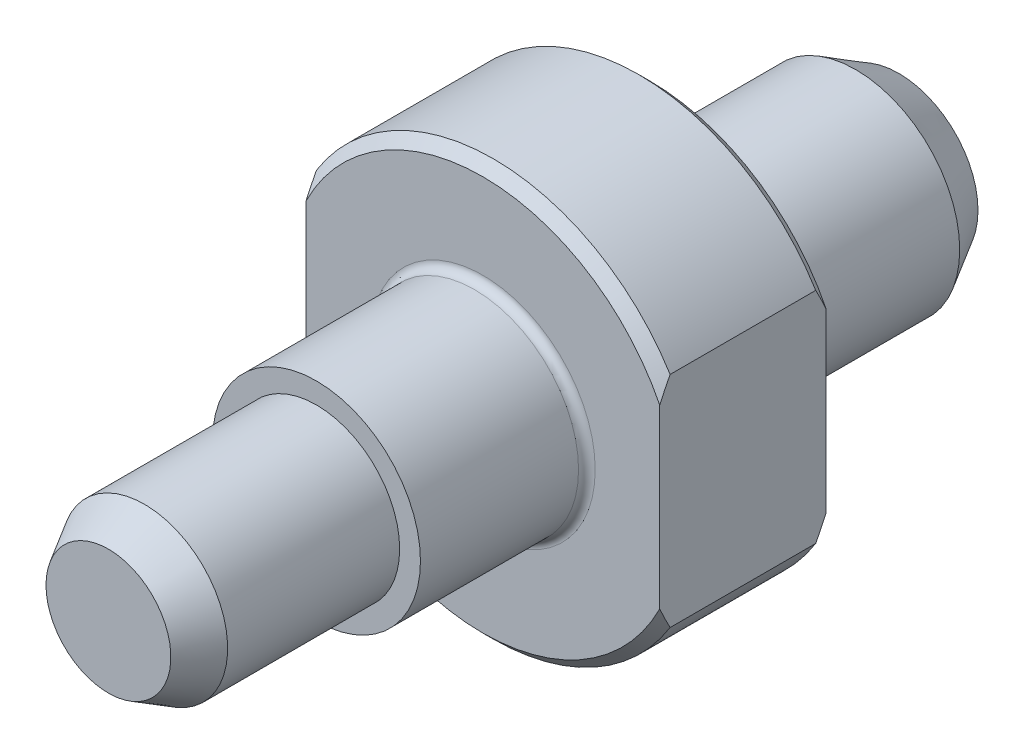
ISO-10303-21;
HEADER;
FILE_DESCRIPTION(('STEP AP214'),'2;1');
FILE_NAME('part.step','',(''),(''),'','','');
FILE_SCHEMA(('AUTOMOTIVE_DESIGN { 1 0 10303 214 1 1 1 1 }'));
ENDSEC;
DATA;
#1=APPLICATION_CONTEXT('core data for automotive mechanical design processes');
#2=APPLICATION_PROTOCOL_DEFINITION('international standard','automotive_design',2000,#1);
#3=PRODUCT_CONTEXT('',#1,'mechanical');
#4=PRODUCT('Part','Part','',(#3));
#5=PRODUCT_RELATED_PRODUCT_CATEGORY('part','',(#4));
#6=PRODUCT_DEFINITION_FORMATION('','',#4);
#7=PRODUCT_DEFINITION_CONTEXT('part definition',#1,'design');
#8=PRODUCT_DEFINITION('design','',#6,#7);
#9=PRODUCT_DEFINITION_SHAPE('','',#8);
#10=(LENGTH_UNIT() NAMED_UNIT(*) SI_UNIT(.MILLI.,.METRE.));
#11=(NAMED_UNIT(*) PLANE_ANGLE_UNIT() SI_UNIT($,.RADIAN.));
#12=(NAMED_UNIT(*) SI_UNIT($,.STERADIAN.) SOLID_ANGLE_UNIT());
#13=UNCERTAINTY_MEASURE_WITH_UNIT(LENGTH_MEASURE(1.E-05),#10,'distance_accuracy_value','');
#14=(GEOMETRIC_REPRESENTATION_CONTEXT(3) GLOBAL_UNCERTAINTY_ASSIGNED_CONTEXT((#13)) GLOBAL_UNIT_ASSIGNED_CONTEXT((#10,
#11,#12)) REPRESENTATION_CONTEXT('',''));
#15=CARTESIAN_POINT('',(0.,0.,0.));
#16=DIRECTION('',(0.,0.,1.));
#17=DIRECTION('',(1.,0.,0.));
#18=AXIS2_PLACEMENT_3D('',#15,#16,#17);
#19=CARTESIAN_POINT('',(0.,0.,0.));
#20=DIRECTION('',(0.,0.,1.));
#21=DIRECTION('',(1.,0.,0.));
#22=AXIS2_PLACEMENT_3D('',#19,#20,#21);
#23=PLANE('',#22);
#24=CARTESIAN_POINT('',(0.,0.,0.));
#25=DIRECTION('',(0.,0.,1.));
#26=DIRECTION('',(1.,0.,0.));
#27=AXIS2_PLACEMENT_3D('',#24,#25,#26);
#28=CIRCLE('',#27,5.4);
#29=CARTESIAN_POINT('',(5.4,0.,0.));
#30=VERTEX_POINT('',#29);
#31=EDGE_CURVE('E190',#30,#30,#28,.T.);
#32=ORIENTED_EDGE('',*,*,#31,.T.);
#33=EDGE_LOOP('',(#32));
#34=FACE_BOUND('',#33,.T.);
#35=DIRECTION('',(0.,-1.,0.));
#36=VECTOR('',#35,1.);
#37=CARTESIAN_POINT('',(8.5,0.,0.));
#38=LINE('',#37,#36);
#39=CARTESIAN_POINT('',(8.5,4.24264068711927,0.));
#40=VERTEX_POINT('',#39);
#41=CARTESIAN_POINT('',(8.5,-4.24264068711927,0.));
#42=VERTEX_POINT('',#41);
#43=EDGE_CURVE('E259',#40,#42,#38,.T.);
#44=ORIENTED_EDGE('',*,*,#43,.T.);
#45=CARTESIAN_POINT('',(0.,0.,0.));
#46=DIRECTION('',(0.,0.,1.));
#47=DIRECTION('',(1.,0.,0.));
#48=AXIS2_PLACEMENT_3D('',#45,#46,#47);
#49=CIRCLE('',#48,9.5);
#50=CARTESIAN_POINT('',(-8.5,-4.24264068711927,0.));
#51=VERTEX_POINT('',#50);
#52=EDGE_CURVE('E392',#42,#51,#49,.F.);
#53=ORIENTED_EDGE('',*,*,#52,.T.);
#54=DIRECTION('',(0.,-1.,0.));
#55=VECTOR('',#54,1.);
#56=CARTESIAN_POINT('',(-8.5,0.,0.));
#57=LINE('',#56,#55);
#58=CARTESIAN_POINT('',(-8.5,4.24264068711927,0.));
#59=VERTEX_POINT('',#58);
#60=EDGE_CURVE('E87',#59,#51,#57,.T.);
#61=ORIENTED_EDGE('',*,*,#60,.F.);
#62=CARTESIAN_POINT('',(0.,0.,0.));
#63=DIRECTION('',(0.,0.,1.));
#64=DIRECTION('',(1.,0.,0.));
#65=AXIS2_PLACEMENT_3D('',#62,#63,#64);
#66=CIRCLE('',#65,9.5);
#67=EDGE_CURVE('E391',#59,#40,#66,.F.);
#68=ORIENTED_EDGE('',*,*,#67,.T.);
#69=EDGE_LOOP('',(#44,#53,#61,#68));
#70=FACE_BOUND('',#69,.T.);
#71=ADVANCED_FACE('F14',(#34,#70),#23,.F.);
#72=CARTESIAN_POINT('',(0.,0.,8.));
#73=DIRECTION('',(0.,0.,-1.));
#74=DIRECTION('',(-1.,0.,0.));
#75=AXIS2_PLACEMENT_3D('',#72,#73,#74);
#76=CYLINDRICAL_SURFACE('',#75,10.);
#77=DIRECTION('',(0.,0.,1.));
#78=VECTOR('',#77,1.);
#79=CARTESIAN_POINT('',(8.5,5.26782687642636,-12.));
#80=LINE('',#79,#78);
#81=CARTESIAN_POINT('',(8.5,5.26782687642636,0.5));
#82=VERTEX_POINT('',#81);
#83=CARTESIAN_POINT('',(8.5,5.26782687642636,7.5));
#84=VERTEX_POINT('',#83);
#85=EDGE_CURVE('E266',#82,#84,#80,.T.);
#86=ORIENTED_EDGE('',*,*,#85,.F.);
#87=CARTESIAN_POINT('',(0.,0.,0.5));
#88=DIRECTION('',(0.,0.,1.));
#89=DIRECTION('',(1.,0.,0.));
#90=AXIS2_PLACEMENT_3D('',#87,#88,#89);
#91=CIRCLE('',#90,10.);
#92=CARTESIAN_POINT('',(-8.5,5.26782687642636,0.5));
#93=VERTEX_POINT('',#92);
#94=EDGE_CURVE('E188',#82,#93,#91,.T.);
#95=ORIENTED_EDGE('',*,*,#94,.T.);
#96=DIRECTION('',(0.,0.,1.));
#97=VECTOR('',#96,1.);
#98=CARTESIAN_POINT('',(-8.5,5.26782687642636,-12.));
#99=LINE('',#98,#97);
#100=CARTESIAN_POINT('',(-8.5,5.26782687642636,7.5));
#101=VERTEX_POINT('',#100);
#102=EDGE_CURVE('E102',#93,#101,#99,.T.);
#103=ORIENTED_EDGE('',*,*,#102,.T.);
#104=CARTESIAN_POINT('',(0.,0.,7.5));
#105=DIRECTION('',(0.,0.,1.));
#106=DIRECTION('',(1.,0.,0.));
#107=AXIS2_PLACEMENT_3D('',#104,#105,#106);
#108=CIRCLE('',#107,10.);
#109=EDGE_CURVE('E186',#101,#84,#108,.F.);
#110=ORIENTED_EDGE('',*,*,#109,.T.);
#111=EDGE_LOOP('',(#86,#95,#103,#110));
#112=FACE_BOUND('',#111,.T.);
#113=ADVANCED_FACE('F216',(#112),#76,.T.);
#114=DIRECTION('',(0.,0.,1.));
#115=VECTOR('',#114,1.);
#116=CARTESIAN_POINT('',(-8.5,-5.26782687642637,-12.));
#117=LINE('',#116,#115);
#118=CARTESIAN_POINT('',(-8.5,-5.26782687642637,0.5));
#119=VERTEX_POINT('',#118);
#120=CARTESIAN_POINT('',(-8.5,-5.26782687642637,7.5));
#121=VERTEX_POINT('',#120);
#122=EDGE_CURVE('E84',#119,#121,#117,.T.);
#123=ORIENTED_EDGE('',*,*,#122,.F.);
#124=CARTESIAN_POINT('',(0.,0.,0.5));
#125=DIRECTION('',(0.,0.,1.));
#126=DIRECTION('',(1.,0.,0.));
#127=AXIS2_PLACEMENT_3D('',#124,#125,#126);
#128=CIRCLE('',#127,10.);
#129=CARTESIAN_POINT('',(8.5,-5.26782687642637,0.5));
#130=VERTEX_POINT('',#129);
#131=EDGE_CURVE('E98',#119,#130,#128,.T.);
#132=ORIENTED_EDGE('',*,*,#131,.T.);
#133=DIRECTION('',(0.,0.,1.));
#134=VECTOR('',#133,1.);
#135=CARTESIAN_POINT('',(8.5,-5.26782687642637,-12.));
#136=LINE('',#135,#134);
#137=CARTESIAN_POINT('',(8.5,-5.26782687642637,7.5));
#138=VERTEX_POINT('',#137);
#139=EDGE_CURVE('E262',#130,#138,#136,.T.);
#140=ORIENTED_EDGE('',*,*,#139,.T.);
#141=CARTESIAN_POINT('',(0.,0.,7.5));
#142=DIRECTION('',(0.,0.,1.));
#143=DIRECTION('',(1.,0.,0.));
#144=AXIS2_PLACEMENT_3D('',#141,#142,#143);
#145=CIRCLE('',#144,10.);
#146=EDGE_CURVE('E101',#138,#121,#145,.F.);
#147=ORIENTED_EDGE('',*,*,#146,.T.);
#148=EDGE_LOOP('',(#123,#132,#140,#147));
#149=FACE_BOUND('',#148,.T.);
#150=ADVANCED_FACE('F96',(#149),#76,.T.);
#151=CARTESIAN_POINT('',(0.,0.,8.));
#152=DIRECTION('',(0.,0.,1.));
#153=DIRECTION('',(1.,0.,0.));
#154=AXIS2_PLACEMENT_3D('',#151,#152,#153);
#155=PLANE('',#154);
#156=CARTESIAN_POINT('',(0.,0.,8.));
#157=DIRECTION('',(0.,0.,1.));
#158=DIRECTION('',(1.,0.,0.));
#159=AXIS2_PLACEMENT_3D('',#156,#157,#158);
#160=CIRCLE('',#159,5.4);
#161=CARTESIAN_POINT('',(5.4,0.,8.));
#162=VERTEX_POINT('',#161);
#163=EDGE_CURVE('E9',#162,#162,#160,.F.);
#164=ORIENTED_EDGE('',*,*,#163,.T.);
#165=EDGE_LOOP('',(#164));
#166=FACE_BOUND('',#165,.T.);
#167=DIRECTION('',(0.,-1.,0.));
#168=VECTOR('',#167,1.);
#169=CARTESIAN_POINT('',(-8.5,5.26782687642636,8.));
#170=LINE('',#169,#168);
#171=CARTESIAN_POINT('',(-8.5,4.24264068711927,8.));
#172=VERTEX_POINT('',#171);
#173=CARTESIAN_POINT('',(-8.5,-4.24264068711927,8.));
#174=VERTEX_POINT('',#173);
#175=EDGE_CURVE('E103',#172,#174,#170,.T.);
#176=ORIENTED_EDGE('',*,*,#175,.T.);
#177=CARTESIAN_POINT('',(0.,0.,8.));
#178=DIRECTION('',(0.,0.,1.));
#179=DIRECTION('',(1.,0.,0.));
#180=AXIS2_PLACEMENT_3D('',#177,#178,#179);
#181=CIRCLE('',#180,9.5);
#182=CARTESIAN_POINT('',(8.5,-4.24264068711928,8.));
#183=VERTEX_POINT('',#182);
#184=EDGE_CURVE('E183',#174,#183,#181,.T.);
#185=ORIENTED_EDGE('',*,*,#184,.T.);
#186=DIRECTION('',(0.,-1.,0.));
#187=VECTOR('',#186,1.);
#188=CARTESIAN_POINT('',(8.5,5.26782687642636,8.));
#189=LINE('',#188,#187);
#190=CARTESIAN_POINT('',(8.5,4.24264068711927,8.));
#191=VERTEX_POINT('',#190);
#192=EDGE_CURVE('E269',#191,#183,#189,.T.);
#193=ORIENTED_EDGE('',*,*,#192,.F.);
#194=CARTESIAN_POINT('',(0.,0.,8.));
#195=DIRECTION('',(0.,0.,1.));
#196=DIRECTION('',(1.,0.,0.));
#197=AXIS2_PLACEMENT_3D('',#194,#195,#196);
#198=CIRCLE('',#197,9.5);
#199=EDGE_CURVE('E91',#191,#172,#198,.T.);
#200=ORIENTED_EDGE('',*,*,#199,.T.);
#201=EDGE_LOOP('',(#176,#185,#193,#200));
#202=FACE_BOUND('',#201,.T.);
#203=ADVANCED_FACE('F229',(#166,#202),#155,.T.);
#204=CARTESIAN_POINT('',(0.,0.,0.));
#205=DIRECTION('',(0.,0.,-1.));
#206=DIRECTION('',(-1.,0.,0.));
#207=AXIS2_PLACEMENT_3D('',#204,#205,#206);
#208=CYLINDRICAL_SURFACE('',#207,5.);
#209=CARTESIAN_POINT('',(0.,0.,-9.92153903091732));
#210=DIRECTION('',(0.,0.,1.));
#211=DIRECTION('',(1.,0.,0.));
#212=AXIS2_PLACEMENT_3D('',#209,#210,#211);
#213=CIRCLE('',#212,5.);
#214=CARTESIAN_POINT('',(5.,0.,-9.92153903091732));
#215=VERTEX_POINT('',#214);
#216=EDGE_CURVE('E276',#215,#215,#213,.T.);
#217=ORIENTED_EDGE('',*,*,#216,.T.);
#218=EDGE_LOOP('',(#217));
#219=FACE_BOUND('',#218,.T.);
#220=CARTESIAN_POINT('',(0.,0.,-0.4));
#221=DIRECTION('',(0.,0.,1.));
#222=DIRECTION('',(1.,0.,0.));
#223=AXIS2_PLACEMENT_3D('',#220,#221,#222);
#224=CIRCLE('',#223,5.);
#225=CARTESIAN_POINT('',(5.,0.,-0.4));
#226=VERTEX_POINT('',#225);
#227=EDGE_CURVE('E193',#226,#226,#224,.F.);
#228=ORIENTED_EDGE('',*,*,#227,.T.);
#229=EDGE_LOOP('',(#228));
#230=FACE_BOUND('',#229,.T.);
#231=ADVANCED_FACE('F231',(#219,#230),#208,.T.);
#232=CARTESIAN_POINT('',(0.,0.,16.));
#233=DIRECTION('',(0.,0.,-1.));
#234=DIRECTION('',(-1.,0.,0.));
#235=AXIS2_PLACEMENT_3D('',#232,#233,#234);
#236=CYLINDRICAL_SURFACE('',#235,5.);
#237=CARTESIAN_POINT('',(0.,0.,8.4));
#238=DIRECTION('',(0.,0.,1.));
#239=DIRECTION('',(1.,0.,0.));
#240=AXIS2_PLACEMENT_3D('',#237,#238,#239);
#241=CIRCLE('',#240,5.);
#242=CARTESIAN_POINT('',(5.,0.,8.4));
#243=VERTEX_POINT('',#242);
#244=EDGE_CURVE('E22',#243,#243,#241,.T.);
#245=ORIENTED_EDGE('',*,*,#244,.T.);
#246=EDGE_LOOP('',(#245));
#247=FACE_BOUND('',#246,.T.);
#248=CARTESIAN_POINT('',(0.,0.,16.));
#249=DIRECTION('',(0.,0.,1.));
#250=DIRECTION('',(1.,0.,0.));
#251=AXIS2_PLACEMENT_3D('',#248,#249,#250);
#252=CIRCLE('',#251,5.);
#253=CARTESIAN_POINT('',(5.,0.,16.));
#254=VERTEX_POINT('',#253);
#255=EDGE_CURVE('E258',#254,#254,#252,.T.);
#256=ORIENTED_EDGE('',*,*,#255,.F.);
#257=EDGE_LOOP('',(#256));
#258=FACE_BOUND('',#257,.T.);
#259=ADVANCED_FACE('F198',(#247,#258),#236,.T.);
#260=CARTESIAN_POINT('',(0.,0.,16.));
#261=DIRECTION('',(0.,0.,1.));
#262=DIRECTION('',(1.,0.,0.));
#263=AXIS2_PLACEMENT_3D('',#260,#261,#262);
#264=PLANE('',#263);
#265=CARTESIAN_POINT('',(0.,0.,16.));
#266=DIRECTION('',(0.,0.,1.));
#267=DIRECTION('',(1.,0.,0.));
#268=AXIS2_PLACEMENT_3D('',#265,#266,#267);
#269=CIRCLE('',#268,4.);
#270=CARTESIAN_POINT('',(4.,0.,16.));
#271=VERTEX_POINT('',#270);
#272=EDGE_CURVE('E111',#271,#271,#269,.T.);
#273=ORIENTED_EDGE('',*,*,#272,.F.);
#274=EDGE_LOOP('',(#273));
#275=FACE_BOUND('',#274,.T.);
#276=ORIENTED_EDGE('',*,*,#255,.T.);
#277=EDGE_LOOP('',(#276));
#278=FACE_BOUND('',#277,.T.);
#279=ADVANCED_FACE('F239',(#275,#278),#264,.T.);
#280=CARTESIAN_POINT('',(0.,0.,26.));
#281=DIRECTION('',(0.,0.,-1.));
#282=DIRECTION('',(-1.,0.,0.));
#283=AXIS2_PLACEMENT_3D('',#280,#281,#282);
#284=CYLINDRICAL_SURFACE('',#283,4.);
#285=CARTESIAN_POINT('',(0.,0.,24.2679491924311));
#286=DIRECTION('',(0.,0.,-1.));
#287=DIRECTION('',(-1.,0.,0.));
#288=AXIS2_PLACEMENT_3D('',#285,#286,#287);
#289=CIRCLE('',#288,4.);
#290=CARTESIAN_POINT('',(-4.,0.,24.2679491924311));
#291=VERTEX_POINT('',#290);
#292=EDGE_CURVE('E281',#291,#291,#289,.T.);
#293=ORIENTED_EDGE('',*,*,#292,.T.);
#294=EDGE_LOOP('',(#293));
#295=FACE_BOUND('',#294,.T.);
#296=ORIENTED_EDGE('',*,*,#272,.T.);
#297=EDGE_LOOP('',(#296));
#298=FACE_BOUND('',#297,.T.);
#299=ADVANCED_FACE('F134',(#295,#298),#284,.T.);
#300=CARTESIAN_POINT('',(8.5,5.26782687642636,-12.));
#301=DIRECTION('',(-1.,0.,0.));
#302=DIRECTION('',(0.,-1.,0.));
#303=AXIS2_PLACEMENT_3D('',#300,#301,#302);
#304=PLANE('',#303);
#305=ORIENTED_EDGE('',*,*,#139,.F.);
#306=CARTESIAN_POINT('',(8.5,-5.26782687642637,0.5));
#307=CARTESIAN_POINT('',(8.5,-5.18370592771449,0.455687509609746));
#308=CARTESIAN_POINT('',(8.5,-5.09926830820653,0.411973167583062));
#309=CARTESIAN_POINT('',(8.5,-4.92976096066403,0.325844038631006));
#310=CARTESIAN_POINT('',(8.5,-4.84469140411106,0.283428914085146));
#311=CARTESIAN_POINT('',(8.5,-4.67387549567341,0.199977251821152));
#312=CARTESIAN_POINT('',(8.5,-4.58812912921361,0.158940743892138));
#313=CARTESIAN_POINT('',(8.5,-4.41592077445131,0.078338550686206));
#314=CARTESIAN_POINT('',(8.5,-4.32945860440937,0.0387732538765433));
#315=CARTESIAN_POINT('',(8.5,-4.24264068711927,0.));
#316=B_SPLINE_CURVE_WITH_KNOTS('',3,(#306,#307,#308,#309,#310,#311,#312,#313,#314,#315),
.UNSPECIFIED.,.F.,.F.,(4,2,2,2,4),(0.,0.285235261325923,0.570395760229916,0.855562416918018,
1.14080384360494),.UNSPECIFIED.);
#317=EDGE_CURVE('E106',#130,#42,#316,.T.);
#318=ORIENTED_EDGE('',*,*,#317,.T.);
#319=ORIENTED_EDGE('',*,*,#43,.F.);
#320=CARTESIAN_POINT('',(8.5,4.24264068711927,0.));
#321=CARTESIAN_POINT('',(8.5,4.32945860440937,0.038773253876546));
#322=CARTESIAN_POINT('',(8.5,4.41592077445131,0.0783385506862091));
#323=CARTESIAN_POINT('',(8.5,4.58812912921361,0.158940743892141));
#324=CARTESIAN_POINT('',(8.5,4.67387549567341,0.199977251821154));
#325=CARTESIAN_POINT('',(8.5,4.84469140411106,0.283428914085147));
#326=CARTESIAN_POINT('',(8.5,4.92976096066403,0.325844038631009));
#327=CARTESIAN_POINT('',(8.5,5.09926830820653,0.411973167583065));
#328=CARTESIAN_POINT('',(8.5,5.18370592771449,0.455687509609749));
#329=CARTESIAN_POINT('',(8.5,5.26782687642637,0.5));
#330=B_SPLINE_CURVE_WITH_KNOTS('',3,(#320,#321,#322,#323,#324,#325,#326,#327,#328,#329),
.UNSPECIFIED.,.F.,.F.,(4,2,2,2,4),(0.,0.285241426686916,0.570408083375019,0.855568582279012,
1.14080384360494),.UNSPECIFIED.);
#331=EDGE_CURVE('E109',#40,#82,#330,.T.);
#332=ORIENTED_EDGE('',*,*,#331,.T.);
#333=ORIENTED_EDGE('',*,*,#85,.T.);
#334=CARTESIAN_POINT('',(8.5,5.26782687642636,7.5));
#335=CARTESIAN_POINT('',(8.5,5.18370592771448,7.54431249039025));
#336=CARTESIAN_POINT('',(8.5,5.09926830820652,7.58802683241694));
#337=CARTESIAN_POINT('',(8.5,4.92976096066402,7.674155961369));
#338=CARTESIAN_POINT('',(8.5,4.84469140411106,7.71657108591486));
#339=CARTESIAN_POINT('',(8.5,4.67387549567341,7.80002274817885));
#340=CARTESIAN_POINT('',(8.5,4.58812912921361,7.84105925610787));
#341=CARTESIAN_POINT('',(8.5,4.41592077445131,7.92166144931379));
#342=CARTESIAN_POINT('',(8.5,4.32945860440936,7.96122674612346));
#343=CARTESIAN_POINT('',(8.5,4.24264068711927,8.));
#344=B_SPLINE_CURVE_WITH_KNOTS('',3,(#334,#335,#336,#337,#338,#339,#340,#341,#342,#343),
.UNSPECIFIED.,.F.,.F.,(4,2,2,2,4),(0.,0.285235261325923,0.570395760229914,0.855562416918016,
1.14080384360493),.UNSPECIFIED.);
#345=EDGE_CURVE('E107',#84,#191,#344,.T.);
#346=ORIENTED_EDGE('',*,*,#345,.T.);
#347=ORIENTED_EDGE('',*,*,#192,.T.);
#348=CARTESIAN_POINT('',(8.5,-4.24264068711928,8.));
#349=CARTESIAN_POINT('',(8.5,-4.32945860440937,7.96122674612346));
#350=CARTESIAN_POINT('',(8.5,-4.41592077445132,7.92166144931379));
#351=CARTESIAN_POINT('',(8.5,-4.58812912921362,7.84105925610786));
#352=CARTESIAN_POINT('',(8.5,-4.67387549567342,7.80002274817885));
#353=CARTESIAN_POINT('',(8.5,-4.84469140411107,7.71657108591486));
#354=CARTESIAN_POINT('',(8.5,-4.92976096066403,7.67415596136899));
#355=CARTESIAN_POINT('',(8.5,-5.09926830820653,7.58802683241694));
#356=CARTESIAN_POINT('',(8.5,-5.18370592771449,7.54431249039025));
#357=CARTESIAN_POINT('',(8.5,-5.26782687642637,7.5));
#358=B_SPLINE_CURVE_WITH_KNOTS('',3,(#348,#349,#350,#351,#352,#353,#354,#355,#356,#357),
.UNSPECIFIED.,.F.,.F.,(4,2,2,2,4),(0.,0.285241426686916,0.570408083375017,0.855568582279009,
1.14080384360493),.UNSPECIFIED.);
#359=EDGE_CURVE('E144',#183,#138,#358,.T.);
#360=ORIENTED_EDGE('',*,*,#359,.T.);
#361=EDGE_LOOP('',(#305,#318,#319,#332,#333,#346,#347,#360));
#362=FACE_BOUND('',#361,.T.);
#363=ADVANCED_FACE('F129',(#362),#304,.F.);
#364=CARTESIAN_POINT('',(-8.5,5.26782687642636,-12.));
#365=DIRECTION('',(-1.,0.,0.));
#366=DIRECTION('',(0.,0.,1.));
#367=AXIS2_PLACEMENT_3D('',#364,#365,#366);
#368=PLANE('',#367);
#369=ORIENTED_EDGE('',*,*,#60,.T.);
#370=CARTESIAN_POINT('',(-8.5,-4.24264068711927,0.));
#371=CARTESIAN_POINT('',(-8.5,-4.32945860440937,0.0387732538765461));
#372=CARTESIAN_POINT('',(-8.5,-4.41592077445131,0.0783385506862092));
#373=CARTESIAN_POINT('',(-8.5,-4.58812912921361,0.158940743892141));
#374=CARTESIAN_POINT('',(-8.5,-4.67387549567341,0.199977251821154));
#375=CARTESIAN_POINT('',(-8.5,-4.84469140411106,0.283428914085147));
#376=CARTESIAN_POINT('',(-8.5,-4.92976096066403,0.325844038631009));
#377=CARTESIAN_POINT('',(-8.5,-5.09926830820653,0.411973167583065));
#378=CARTESIAN_POINT('',(-8.5,-5.18370592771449,0.455687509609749));
#379=CARTESIAN_POINT('',(-8.5,-5.26782687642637,0.5));
#380=B_SPLINE_CURVE_WITH_KNOTS('',3,(#370,#371,#372,#373,#374,#375,#376,#377,#378,#379),
.UNSPECIFIED.,.F.,.F.,(4,2,2,2,4),(0.,0.285241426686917,0.57040808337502,0.855568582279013,
1.14080384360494),.UNSPECIFIED.);
#381=EDGE_CURVE('E81',#51,#119,#380,.T.);
#382=ORIENTED_EDGE('',*,*,#381,.T.);
#383=ORIENTED_EDGE('',*,*,#122,.T.);
#384=CARTESIAN_POINT('',(-8.5,-5.26782687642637,7.5));
#385=CARTESIAN_POINT('',(-8.5,-5.18370592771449,7.54431249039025));
#386=CARTESIAN_POINT('',(-8.5,-5.09926830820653,7.58802683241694));
#387=CARTESIAN_POINT('',(-8.5,-4.92976096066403,7.67415596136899));
#388=CARTESIAN_POINT('',(-8.5,-4.84469140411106,7.71657108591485));
#389=CARTESIAN_POINT('',(-8.5,-4.67387549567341,7.80002274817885));
#390=CARTESIAN_POINT('',(-8.5,-4.58812912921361,7.84105925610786));
#391=CARTESIAN_POINT('',(-8.5,-4.41592077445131,7.92166144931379));
#392=CARTESIAN_POINT('',(-8.5,-4.32945860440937,7.96122674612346));
#393=CARTESIAN_POINT('',(-8.5,-4.24264068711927,8.));
#394=B_SPLINE_CURVE_WITH_KNOTS('',3,(#384,#385,#386,#387,#388,#389,#390,#391,#392,#393),
.UNSPECIFIED.,.F.,.F.,(4,2,2,2,4),(0.,0.285235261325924,0.570395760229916,0.855562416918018,
1.14080384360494),.UNSPECIFIED.);
#395=EDGE_CURVE('E92',#121,#174,#394,.T.);
#396=ORIENTED_EDGE('',*,*,#395,.T.);
#397=ORIENTED_EDGE('',*,*,#175,.F.);
#398=CARTESIAN_POINT('',(-8.5,4.24264068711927,8.));
#399=CARTESIAN_POINT('',(-8.5,4.32945860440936,7.96122674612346));
#400=CARTESIAN_POINT('',(-8.5,4.41592077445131,7.92166144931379));
#401=CARTESIAN_POINT('',(-8.5,4.58812912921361,7.84105925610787));
#402=CARTESIAN_POINT('',(-8.5,4.67387549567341,7.80002274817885));
#403=CARTESIAN_POINT('',(-8.5,4.84469140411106,7.71657108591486));
#404=CARTESIAN_POINT('',(-8.5,4.92976096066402,7.674155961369));
#405=CARTESIAN_POINT('',(-8.5,5.09926830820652,7.58802683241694));
#406=CARTESIAN_POINT('',(-8.5,5.18370592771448,7.54431249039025));
#407=CARTESIAN_POINT('',(-8.5,5.26782687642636,7.5));
#408=B_SPLINE_CURVE_WITH_KNOTS('',3,(#398,#399,#400,#401,#402,#403,#404,#405,#406,#407),
.UNSPECIFIED.,.F.,.F.,(4,2,2,2,4),(0.,0.285241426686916,0.570408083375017,0.855568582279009,
1.14080384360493),.UNSPECIFIED.);
#409=EDGE_CURVE('E29',#172,#101,#408,.T.);
#410=ORIENTED_EDGE('',*,*,#409,.T.);
#411=ORIENTED_EDGE('',*,*,#102,.F.);
#412=CARTESIAN_POINT('',(-8.5,5.26782687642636,0.5));
#413=CARTESIAN_POINT('',(-8.5,5.18370592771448,0.455687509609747));
#414=CARTESIAN_POINT('',(-8.5,5.09926830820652,0.411973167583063));
#415=CARTESIAN_POINT('',(-8.5,4.92976096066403,0.325844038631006));
#416=CARTESIAN_POINT('',(-8.5,4.84469140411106,0.283428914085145));
#417=CARTESIAN_POINT('',(-8.5,4.67387549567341,0.199977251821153));
#418=CARTESIAN_POINT('',(-8.5,4.58812912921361,0.15894074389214));
#419=CARTESIAN_POINT('',(-8.5,4.41592077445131,0.0783385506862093));
#420=CARTESIAN_POINT('',(-8.5,4.32945860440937,0.0387732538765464));
#421=CARTESIAN_POINT('',(-8.5,4.24264068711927,0.));
#422=B_SPLINE_CURVE_WITH_KNOTS('',3,(#412,#413,#414,#415,#416,#417,#418,#419,#420,#421),
.UNSPECIFIED.,.F.,.F.,(4,2,2,2,4),(0.,0.285235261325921,0.57039576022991,0.855562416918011,
1.14080384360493),.UNSPECIFIED.);
#423=EDGE_CURVE('E37',#93,#59,#422,.T.);
#424=ORIENTED_EDGE('',*,*,#423,.T.);
#425=EDGE_LOOP('',(#369,#382,#383,#396,#397,#410,#411,#424));
#426=FACE_BOUND('',#425,.T.);
#427=ADVANCED_FACE('F83',(#426),#368,.T.);
#428=CARTESIAN_POINT('',(0.,0.,0.5));
#429=DIRECTION('',(0.,0.,1.));
#430=DIRECTION('',(1.,0.,0.));
#431=AXIS2_PLACEMENT_3D('',#428,#429,#430);
#432=CONICAL_SURFACE('',#431,10.,0.785398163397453);
#433=ORIENTED_EDGE('',*,*,#381,.F.);
#434=ORIENTED_EDGE('',*,*,#52,.F.);
#435=ORIENTED_EDGE('',*,*,#317,.F.);
#436=ORIENTED_EDGE('',*,*,#131,.F.);
#437=EDGE_LOOP('',(#433,#434,#435,#436));
#438=FACE_BOUND('',#437,.T.);
#439=ADVANCED_FACE('F105',(#438),#432,.T.);
#440=CARTESIAN_POINT('',(0.,0.,8.));
#441=DIRECTION('',(0.,0.,-1.));
#442=DIRECTION('',(-1.,0.,0.));
#443=AXIS2_PLACEMENT_3D('',#440,#441,#442);
#444=CONICAL_SURFACE('',#443,9.5,0.78539816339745);
#445=ORIENTED_EDGE('',*,*,#395,.F.);
#446=ORIENTED_EDGE('',*,*,#146,.F.);
#447=ORIENTED_EDGE('',*,*,#359,.F.);
#448=ORIENTED_EDGE('',*,*,#184,.F.);
#449=EDGE_LOOP('',(#445,#446,#447,#448));
#450=FACE_BOUND('',#449,.T.);
#451=ADVANCED_FACE('F156',(#450),#444,.T.);
#452=CARTESIAN_POINT('',(0.,0.,0.5));
#453=DIRECTION('',(0.,0.,1.));
#454=DIRECTION('',(1.,0.,0.));
#455=AXIS2_PLACEMENT_3D('',#452,#453,#454);
#456=CONICAL_SURFACE('',#455,10.,0.785398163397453);
#457=ORIENTED_EDGE('',*,*,#331,.F.);
#458=ORIENTED_EDGE('',*,*,#67,.F.);
#459=ORIENTED_EDGE('',*,*,#423,.F.);
#460=ORIENTED_EDGE('',*,*,#94,.F.);
#461=EDGE_LOOP('',(#457,#458,#459,#460));
#462=FACE_BOUND('',#461,.T.);
#463=ADVANCED_FACE('F159',(#462),#456,.T.);
#464=CARTESIAN_POINT('',(0.,0.,8.));
#465=DIRECTION('',(0.,0.,-1.));
#466=DIRECTION('',(-1.,0.,0.));
#467=AXIS2_PLACEMENT_3D('',#464,#465,#466);
#468=CONICAL_SURFACE('',#467,9.5,0.78539816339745);
#469=ORIENTED_EDGE('',*,*,#345,.F.);
#470=ORIENTED_EDGE('',*,*,#109,.F.);
#471=ORIENTED_EDGE('',*,*,#409,.F.);
#472=ORIENTED_EDGE('',*,*,#199,.F.);
#473=EDGE_LOOP('',(#469,#470,#471,#472));
#474=FACE_BOUND('',#473,.T.);
#475=ADVANCED_FACE('F127',(#474),#468,.T.);
#476=CARTESIAN_POINT('',(0.,0.,-0.4));
#477=DIRECTION('',(0.,0.,1.));
#478=DIRECTION('',(1.,0.,0.));
#479=AXIS2_PLACEMENT_3D('',#476,#477,#478);
#480=TOROIDAL_SURFACE('',#479,5.4,0.4);
#481=ORIENTED_EDGE('',*,*,#227,.F.);
#482=EDGE_LOOP('',(#481));
#483=FACE_BOUND('',#482,.T.);
#484=ORIENTED_EDGE('',*,*,#31,.F.);
#485=EDGE_LOOP('',(#484));
#486=FACE_BOUND('',#485,.T.);
#487=ADVANCED_FACE('F203',(#483,#486),#480,.F.);
#488=CARTESIAN_POINT('',(0.,0.,8.4));
#489=DIRECTION('',(0.,0.,1.));
#490=DIRECTION('',(1.,0.,0.));
#491=AXIS2_PLACEMENT_3D('',#488,#489,#490);
#492=TOROIDAL_SURFACE('',#491,5.4,0.4);
#493=ORIENTED_EDGE('',*,*,#163,.F.);
#494=EDGE_LOOP('',(#493));
#495=FACE_BOUND('',#494,.T.);
#496=ORIENTED_EDGE('',*,*,#244,.F.);
#497=EDGE_LOOP('',(#496));
#498=FACE_BOUND('',#497,.T.);
#499=ADVANCED_FACE('F16',(#495,#498),#492,.F.);
#500=CARTESIAN_POINT('',(0.,0.,-7.37173752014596));
#501=DIRECTION('',(0.,0.,1.));
#502=DIRECTION('',(1.,0.,0.));
#503=AXIS2_PLACEMENT_3D('',#500,#501,#502);
#504=CONICAL_SURFACE('',#503,6.47212858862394,0.523598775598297);
#505=CARTESIAN_POINT('',(0.,0.,-12.));
#506=DIRECTION('',(0.,0.,-1.));
#507=DIRECTION('',(-1.,0.,0.));
#508=AXIS2_PLACEMENT_3D('',#505,#506,#507);
#509=CIRCLE('',#508,3.8);
#510=CARTESIAN_POINT('',(-3.8,0.,-12.));
#511=VERTEX_POINT('',#510);
#512=EDGE_CURVE('E278',#511,#511,#509,.T.);
#513=ORIENTED_EDGE('',*,*,#512,.F.);
#514=EDGE_LOOP('',(#513));
#515=FACE_BOUND('',#514,.T.);
#516=ORIENTED_EDGE('',*,*,#216,.F.);
#517=EDGE_LOOP('',(#516));
#518=FACE_BOUND('',#517,.T.);
#519=ADVANCED_FACE('F202',(#515,#518),#504,.T.);
#520=CARTESIAN_POINT('',(0.,0.,-12.));
#521=DIRECTION('',(0.,0.,1.));
#522=DIRECTION('',(1.,0.,0.));
#523=AXIS2_PLACEMENT_3D('',#520,#521,#522);
#524=PLANE('',#523);
#525=ORIENTED_EDGE('',*,*,#512,.T.);
#526=EDGE_LOOP('',(#525));
#527=FACE_BOUND('',#526,.T.);
#528=ADVANCED_FACE('F211',(#527),#524,.F.);
#529=CARTESIAN_POINT('',(0.,0.,26.));
#530=DIRECTION('',(0.,0.,-1.));
#531=DIRECTION('',(-1.,0.,0.));
#532=AXIS2_PLACEMENT_3D('',#529,#530,#531);
#533=CONICAL_SURFACE('',#532,3.,0.523598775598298);
#534=CARTESIAN_POINT('',(0.,0.,26.));
#535=DIRECTION('',(0.,0.,-1.));
#536=DIRECTION('',(-1.,0.,0.));
#537=AXIS2_PLACEMENT_3D('',#534,#535,#536);
#538=CIRCLE('',#537,3.);
#539=CARTESIAN_POINT('',(-3.,0.,26.));
#540=VERTEX_POINT('',#539);
#541=EDGE_CURVE('E284',#540,#540,#538,.T.);
#542=ORIENTED_EDGE('',*,*,#541,.T.);
#543=EDGE_LOOP('',(#542));
#544=FACE_BOUND('',#543,.T.);
#545=ORIENTED_EDGE('',*,*,#292,.F.);
#546=EDGE_LOOP('',(#545));
#547=FACE_BOUND('',#546,.T.);
#548=ADVANCED_FACE('F235',(#544,#547),#533,.T.);
#549=CARTESIAN_POINT('',(0.,0.,26.));
#550=DIRECTION('',(0.,0.,1.));
#551=DIRECTION('',(1.,0.,0.));
#552=AXIS2_PLACEMENT_3D('',#549,#550,#551);
#553=PLANE('',#552);
#554=ORIENTED_EDGE('',*,*,#541,.F.);
#555=EDGE_LOOP('',(#554));
#556=FACE_BOUND('',#555,.T.);
#557=ADVANCED_FACE('F138',(#556),#553,.T.);
#558=CLOSED_SHELL('',(#71,#113,#150,#203,#231,#259,#279,#299,#363,#427,#439,#451,#463,#475,#487,
#499,#519,#528,#548,#557));
#559=MANIFOLD_SOLID_BREP('B1',#558);
#560=ADVANCED_BREP_SHAPE_REPRESENTATION('',(#18,#559),#14);
#561=SHAPE_DEFINITION_REPRESENTATION(#9,#560);
ENDSEC;
END-ISO-10303-21;
